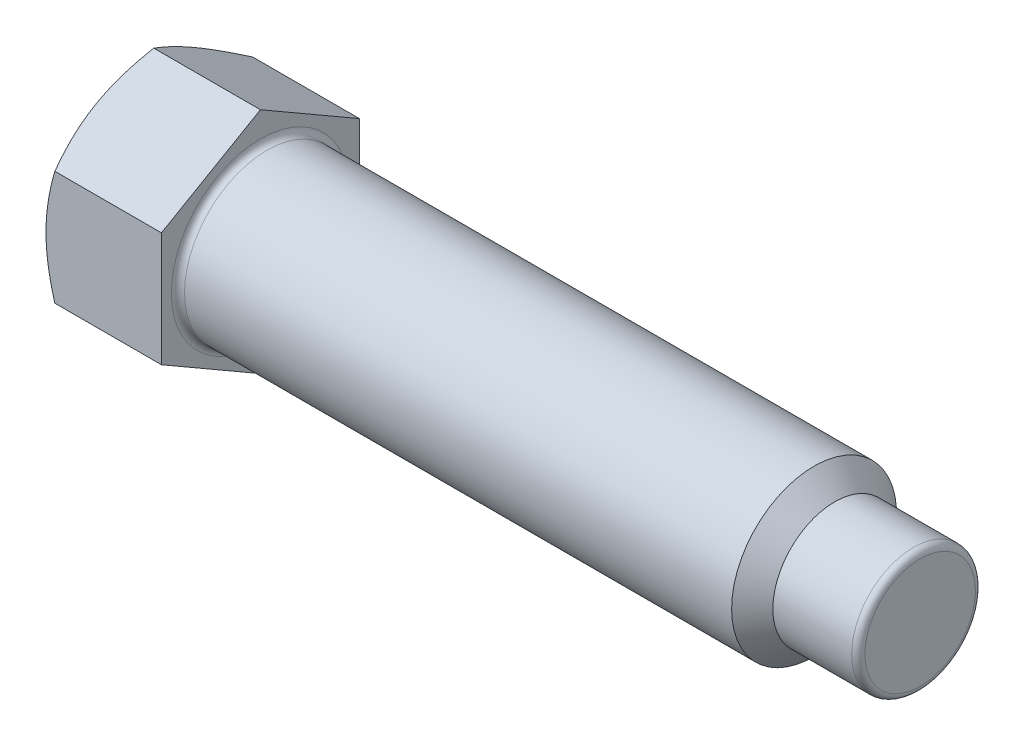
from build123d import *

# Parameters (mm, degrees)
BASEHEAD_DEPTH   = 14
HEADFILLET_R     = 0.8
BASEBODYFILLET_R = 0.8


with BuildPart() as part:
    # HexSke → BaseHead (new body)
    with BuildSketch(Plane(origin=(0, 0, 0), x_dir=(0, 0, -1), z_dir=(1, 0, 0))):
        Polygon((12, 6.92820323), (12, -6.92820323), (0, -13.856406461), (-12, -6.92820323), (-12, 6.92820323), (0, 13.856406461), align=None)
    extrude(amount=BASEHEAD_DEPTH)

    # BodySke → BaseBody (revolve)
    with BuildSketch(Plane.XY, mode=Mode.PRIVATE) as basebody_sk:
        Polygon((0, 0), (94, 0), (94, 7.5), (83.64, 7.5), (81.14, 10), (0, 10), align=None)
    revolve(basebody_sk.sketch.rotate(Axis((0, 0, 0), (1, 0, 0)), 90), axis=Axis((0, 0, 0), (1, 0, 0)))

    # HeadChamSke → HeadChamfer (revolve, cut)
    with BuildSketch(Plane.XY):
        Polygon((0, 12), (3.958548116, 18.856406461), (3.958548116, 23.856406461), (-10, 23.856406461), (-10, 12), align=None)
    revolve(axis=Axis((0, 0, 0), (1, 0, 0)), mode=Mode.SUBTRACT)

    # HeadFillet
    headfillet_edges = [part.edges().sort_by_distance(p)[0] for p in [
        (14, 0, -10),
    ]]
    fillet(headfillet_edges, radius=HEADFILLET_R)

    # BaseBodyFillet
    basebodyfillet_edges = [part.edges().sort_by_distance(p)[0] for p in [
        (94, 0, -7.5),
    ]]
    fillet(basebodyfillet_edges, radius=BASEBODYFILLET_R)


solid = part.part
